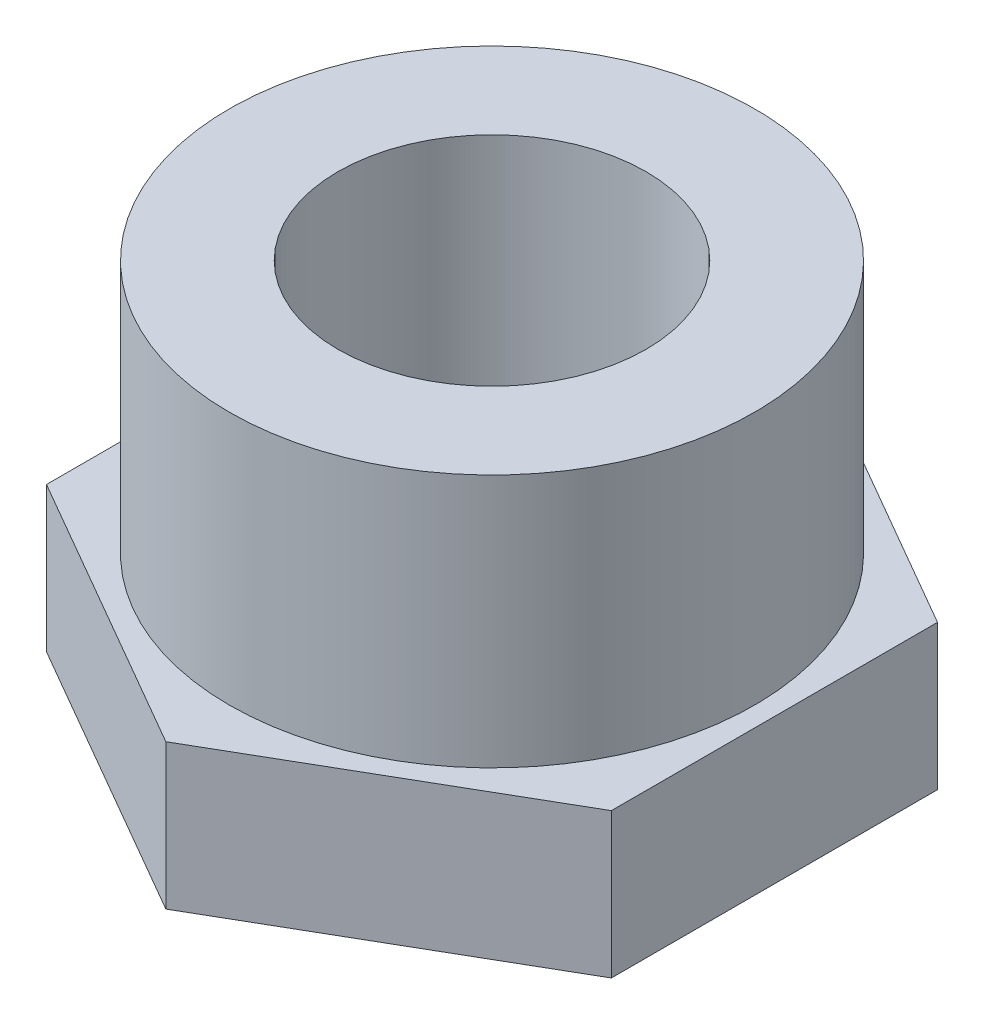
from build123d import *

# Parameters (mm, degrees)
SKETCH1_R           = 10.795
BOSS_EXTRUDE2_DEPTH = 10.16
SKETCH2_R           = 18.415
SKETCH2_R_2         = 10.795
BOSS_EXTRUDE3_DEPTH = 17.78


with BuildPart() as part:
    # Sketch1 → Boss-Extrude2 (new body)
    with BuildSketch(Plane(origin=(0, 0, 0), x_dir=(1, 0, 0), z_dir=(0, 1, 0))):
        Polygon((0, 22.86), (-19.797340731, 11.43), (-19.797340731, -11.43), (0, -22.86), (19.797340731, -11.43), (19.797340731, 11.43), align=None)
        with Locations(Location((0, 0, 0), (0, 0, 270))):
            Circle(SKETCH1_R, mode=Mode.SUBTRACT)
    extrude(amount=BOSS_EXTRUDE2_DEPTH)

    # Sketch2 → Boss-Extrude3 (add)
    with BuildSketch(Plane(origin=(0, 10.16, 0), x_dir=(1, 0, 0), z_dir=(0, 1, 0))):
        with Locations(Location((0, 0, 0), (0, 0, 270))):
            Circle(SKETCH2_R)
        with Locations(Location((0, 0, 0), (0, 0, 270))):
            Circle(SKETCH2_R_2, mode=Mode.SUBTRACT)
    extrude(amount=BOSS_EXTRUDE3_DEPTH)


solid = part.part
